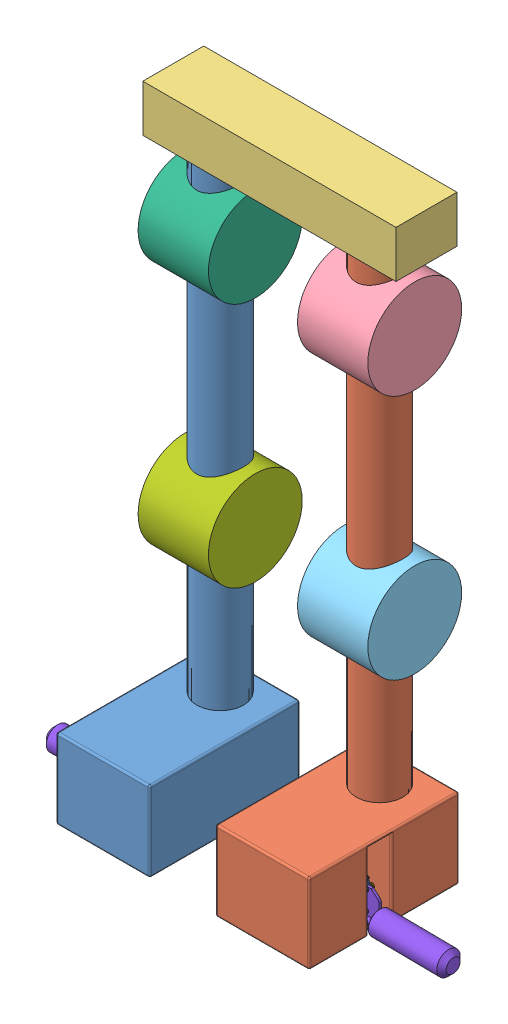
SolidWorks assembly Assem1.SLDASM, configuration Default (file format 14000). Lengths in mm.
Overall size (428.14 732.61 198.07).
49 component instances, 16 part files, 17 mates.
Components (placement in the parent):
- foot 1-1: foot 1.SLDPRT [Default] at (63.8048 0.6497 487.5783) size (100 590 160)
- foot 2-1: foot 2.SLDPRT [Default] at (233.8048 0.6497 487.5783) size (100 590 160)
- weist-1: weist.SLDPRT [Default] at (153.8052 590.6497 491.9278) size (270 50 65)
- 1 (1)-1: 1 (1).SLDPRT [Default] at (186.2952 517.8949 504.0203) size (75 100 100)
- 1 (2)-1: 1 (2).SLDPRT [Default] at (186.2952 255.7611 504.0203) size (75 100 100)
- 1 (3)-1: 1 (3).SLDPRT [Default] at (16.2952 517.8949 504.0203) size (75 100 100)
- 1 (4)-1: 1 (4).SLDPRT [Default] at (16.2952 255.7611 504.0203) size (75 100 100)
- final-2: final.SLDASM [Default] at (-70.139 6.2617 553.916) x (0.999933 0.011569 0) z (0 0 1) size (148.74 196.36 196.36)
  - part5-1: part5.SLDPRT [Default] x (0 -0.791913 -0.610634) z (1 0 0) size (140 140 63)
  - Part7-1: Part7.SLDPRT [Default] at (63 0 0) x (0 -0.533886 -0.845556) z (1 0 0) size (85 85 10)
  - part6-1: part6.SLDPRT [Default] at (16 0 0) size (94 41.69 29.99)
  - Part8-1: Part8.SLDPRT [Default] at (87.5 25 -10.5) x (-0.723993 -0.689807 0) z (0 0 1) size (6 6 16)
  - Part2-1: Part2.SLDPRT [Default] at (92.9524 31.5696 0) x (0 0 1) z (0.769505 -0.638641 0) size (10.3 28.5 10.3)
  - Part3-1: Part3.SLDPRT [Default] at (107.1194 -5.67 0) x (-0.995728 -0.092332 0) z (0.092332 -0.995728 0) size (37.5 5 5)
  - Part3-2: Part3.SLDPRT [Default] at (107.4354 7.5 0) x (-1 0 0) z (0 -1 0) size (37.5 5 5)
  - Part8-2: Part8.SLDPRT [Default] at (87.5 5 -10.5) x (-0.96854 0.248858 0) z (0 0 1) size (6 6 16)
  - Part8-3: Part8.SLDPRT [Default] at (87.5 -10 -10.5) x (-0.152895 0.988242 0) z (0 0 1) size (6 6 16)
  - Part4-1: Part4.SLDPRT [Default] at (132.9059 27.3137 -0.25) x (0.011569 0.999933 0) z (0 0 1) size (80 28 22.45)
  - Part8-4: Part8.SLDPRT [Default] at (120 5 -8.75) x (-0.910491 -0.413528 0) z (0 0 1) size (6 6 16)
  - Part8-5: Part8.SLDPRT [Default] at (119.8612 -6.9992 -8.75) x (-0.549173 -0.835709 0) z (0 0 1) size (6 6 16)
  - Part1-1: Part1.SLDPRT [Default] at (118.1396 61.918 0) x (0.769505 -0.638641 0) z (0 0 1) size (11 29 11)
  - Part8-6: Part8.SLDPRT [Default] at (120.6942 64.996 -8.75) x (-0.100518 0.994935 0) z (0 0 1) size (6 6 16)
  - Part9-1: Part9.SLDPRT [Default] at (87.5 -10 -6) size (5.2 4.5 3.5)
  - Part9-2: Part9.SLDPRT [Default] at (87.5 5 -6) size (5.2 4.5 3.5)
  - Part9-3: Part9.SLDPRT [Default] at (120.6942 64.996 -8.25) size (5.2 4.5 3.5)
  - Part9-4: Part9.SLDPRT [Default] at (120 5 -8.25) size (5.2 4.5 3.5)
  - Part9-5: Part9.SLDPRT [Default] at (87.5 25 -6) size (5.2 4.5 3.5)
  - Part9-6: Part9.SLDPRT [Default] at (119.8612 -6.9992 -8.25) size (5.2 4.5 3.5)
- final-4: final.SLDASM [Default] at (347.7293 6.2617 553.4696) x (-0.999933 0.011569 0) z (0 0 -1) size (148.74 196.36 196.36)
  - part5-1: part5.SLDPRT [Default] x (0 -0.791913 -0.610634) z (1 0 0) size (140 140 63)
  - Part7-1: Part7.SLDPRT [Default] at (63 0 0) x (0 -0.533886 -0.845556) z (1 0 0) size (85 85 10)
  - part6-1: part6.SLDPRT [Default] at (16 0 0) size (94 41.69 29.99)
  - Part8-1: Part8.SLDPRT [Default] at (87.5 25 -10.5) x (-0.723993 -0.689807 0) z (0 0 1) size (6 6 16)
  - Part2-1: Part2.SLDPRT [Default] at (92.9524 31.5696 0) x (0 0 1) z (0.769505 -0.638641 0) size (10.3 28.5 10.3)
  - Part3-1: Part3.SLDPRT [Default] at (107.1194 -5.67 0) x (-0.995728 -0.092332 0) z (0.092332 -0.995728 0) size (37.5 5 5)
  - Part3-2: Part3.SLDPRT [Default] at (107.4354 7.5 0) x (-1 0 0) z (0 -1 0) size (37.5 5 5)
  - Part8-2: Part8.SLDPRT [Default] at (87.5 5 -10.5) x (-0.96854 0.248858 0) z (0 0 1) size (6 6 16)
  - Part8-3: Part8.SLDPRT [Default] at (87.5 -10 -10.5) x (-0.152895 0.988242 0) z (0 0 1) size (6 6 16)
  - Part4-1: Part4.SLDPRT [Default] at (132.9059 27.3137 -0.25) x (0.011569 0.999933 0) z (0 0 1) size (80 28 22.45)
  - Part8-4: Part8.SLDPRT [Default] at (120 5 -8.75) x (-0.910491 -0.413528 0) z (0 0 1) size (6 6 16)
  - Part8-5: Part8.SLDPRT [Default] at (119.8612 -6.9992 -8.75) x (-0.549173 -0.835709 0) z (0 0 1) size (6 6 16)
  - Part1-1: Part1.SLDPRT [Default] at (118.1396 61.918 0) x (0.769505 -0.638641 0) z (0 0 1) size (11 29 11)
  - Part8-6: Part8.SLDPRT [Default] at (120.6942 64.996 -8.75) x (-0.100518 0.994935 0) z (0 0 1) size (6 6 16)
  - Part9-1: Part9.SLDPRT [Default] at (87.5 -10 -6) size (5.2 4.5 3.5)
  - Part9-2: Part9.SLDPRT [Default] at (87.5 5 -6) size (5.2 4.5 3.5)
  - Part9-3: Part9.SLDPRT [Default] at (120.6942 64.996 -8.25) size (5.2 4.5 3.5)
  - Part9-4: Part9.SLDPRT [Default] at (120 5 -8.25) size (5.2 4.5 3.5)
  - Part9-5: Part9.SLDPRT [Default] at (87.5 25 -6) size (5.2 4.5 3.5)
  - Part9-6: Part9.SLDPRT [Default] at (119.8612 -6.9992 -8.25) size (5.2 4.5 3.5)
Mates (geometry in assembly coordinates):
- Coincident1: coincident aligned: circle of foot 1-1; circle of weist-1
- Coincident2: coincident aligned: circle of foot 2-1; circle of weist-1
- Concentric6: concentric aligned: cylinder of foot 2-1 through (223.7952 590.6497 504.0203) axis (0 -1 0) radius 25; cylinder of 1 (1)-1 through (223.7952 617.8949 504.0203) axis (0 -1 0) radius 25
- Concentric7: concentric aligned: cylinder of foot 2-1 through (223.7952 590.6497 504.0203) axis (0 -1 0) radius 25; cylinder of 1 (2)-1 through (223.7952 355.7611 504.0203) axis (0 -1 0) radius 25
- Concentric8: concentric aligned: cylinder of foot 1-1 through (53.7952 590.6497 504.0203) axis (0 -1 0) radius 25; cylinder of 1 (3)-1 through (53.7952 617.8949 504.0203) axis (0 -1 0) radius 25
- Concentric9: concentric aligned: cylinder of foot 1-1 through (53.7952 590.6497 504.0203) axis (0 -1 0) radius 25; cylinder of 1 (4)-1 through (53.7952 355.7611 504.0203) axis (0 -1 0) radius 25
- Parallel6: parallel anti-aligned: plane of 1 (2)-1 through (186.2952 255.7611 504.0203) normal (-1 0 0); plane of 1 (4)-1 through (91.2952 255.7611 504.0203) normal (1 0 0)
- Parallel7: parallel anti-aligned: plane of 1 (1)-1 through (186.2952 517.8949 504.0203) normal (-1 0 0); plane of 1 (3)-1 through (91.2952 517.8949 504.0203) normal (1 0 0)
- Parallel8: parallel anti-aligned: plane of foot 1-1 through (103.7952 85.6497 469.0203) normal (1 0 0); plane of foot 2-1 through (173.7952 85.6497 469.0203) normal (-1 0 0)
- Parallel11: parallel aligned: plane of foot 2-1 through (273.7952 85.6497 469.0203) normal (1 0 0); plane of weist-1 through (273.7952 640.6497 471.5203) normal (1 0 0)
- Parallel12: parallel aligned: plane of foot 1-1 through (3.7952 85.6497 469.0203) normal (-1 0 0); plane of weist-1 through (3.7952 640.6497 471.5203) normal (-1 0 0)
- Concentric10: concentric aligned: cylinder of 1 (2)-1 through (261.2952 255.7611 504.0203) axis (-1 0 0) radius 50; cylinder of 1 (4)-1 through (91.2952 255.7611 504.0203) axis (-1 0 0) radius 50
- Concentric11: concentric aligned: cylinder of 1 (1)-1 through (261.2952 517.8949 504.0203) axis (-1 0 0) radius 50; cylinder of 1 (3)-1 through (91.2952 517.8949 504.0203) axis (-1 0 0) radius 50
- Coincident9: coincident anti-aligned: line of foot 1-1 through (73.7952 0.6497 541.2564) axis (0 0 1); line of final-2/Part4-1 through (73.7952 0.6497 564.866) axis (0 0 -1)
- Coincident13: coincident anti-aligned: plane of foot 1-1 through (73.7952 0.6497 487.5783) normal (-1 0 0); plane of final-2/Part4-1 through (73.7952 35.1112 564.866) normal (1 0 0)
- Coincident15: coincident anti-aligned: plane of foot 2-1 through (203.7952 0.6497 487.5783) normal (1 0 0); plane of final-4/Part4-1 through (203.7952 35.1112 542.5196) normal (-1 0 0)
- Coincident16: coincident anti-aligned: line of foot 2-1 through (203.7952 0.6497 566.2564) axis (0 0 -1); line of final-4/Part4-1 through (203.7952 0.6497 542.5196) axis (0 0 1)
